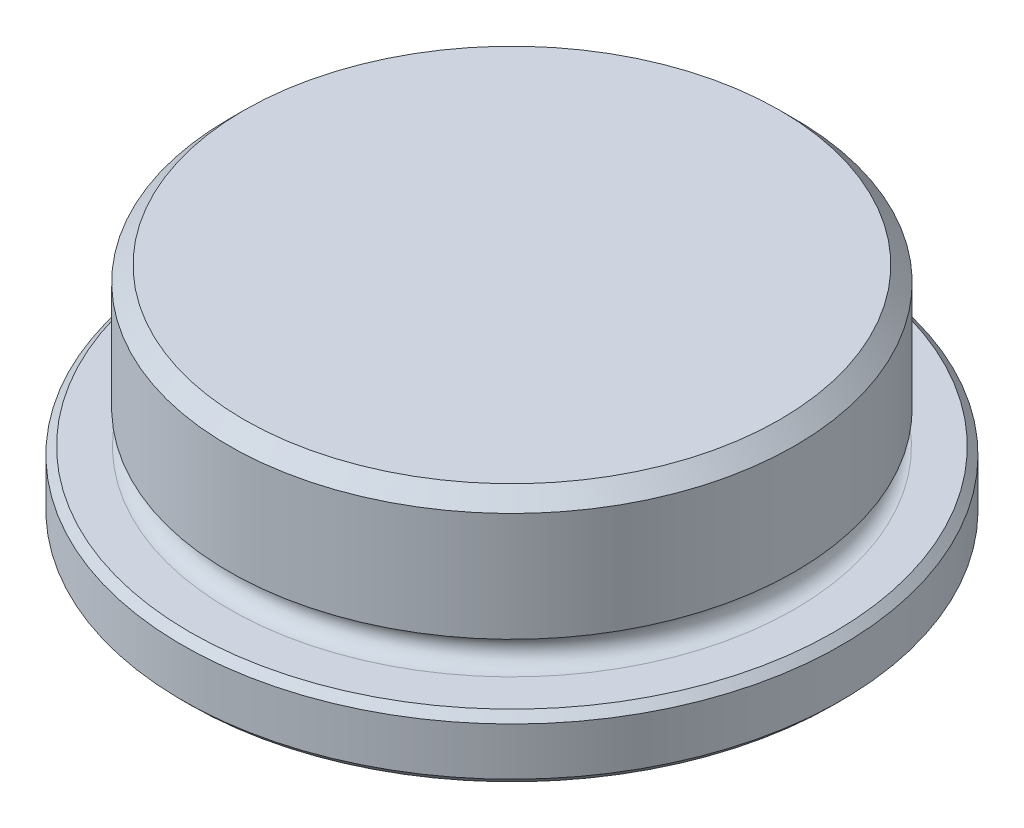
ISO-10303-21;
HEADER;
FILE_DESCRIPTION(('STEP AP214'),'2;1');
FILE_NAME('part.step','',(''),(''),'','','');
FILE_SCHEMA(('AUTOMOTIVE_DESIGN { 1 0 10303 214 1 1 1 1 }'));
ENDSEC;
DATA;
#1=APPLICATION_CONTEXT('core data for automotive mechanical design processes');
#2=APPLICATION_PROTOCOL_DEFINITION('international standard','automotive_design',2000,#1);
#3=PRODUCT_CONTEXT('',#1,'mechanical');
#4=PRODUCT('Part','Part','',(#3));
#5=PRODUCT_RELATED_PRODUCT_CATEGORY('part','',(#4));
#6=PRODUCT_DEFINITION_FORMATION('','',#4);
#7=PRODUCT_DEFINITION_CONTEXT('part definition',#1,'design');
#8=PRODUCT_DEFINITION('design','',#6,#7);
#9=PRODUCT_DEFINITION_SHAPE('','',#8);
#10=(LENGTH_UNIT() NAMED_UNIT(*) SI_UNIT(.MILLI.,.METRE.));
#11=(NAMED_UNIT(*) PLANE_ANGLE_UNIT() SI_UNIT($,.RADIAN.));
#12=(NAMED_UNIT(*) SI_UNIT($,.STERADIAN.) SOLID_ANGLE_UNIT());
#13=UNCERTAINTY_MEASURE_WITH_UNIT(LENGTH_MEASURE(1.E-05),#10,'distance_accuracy_value','');
#14=(GEOMETRIC_REPRESENTATION_CONTEXT(3) GLOBAL_UNCERTAINTY_ASSIGNED_CONTEXT((#13)) GLOBAL_UNIT_ASSIGNED_CONTEXT((#10,
#11,#12)) REPRESENTATION_CONTEXT('',''));
#15=CARTESIAN_POINT('',(0.,0.,0.));
#16=DIRECTION('',(0.,0.,1.));
#17=DIRECTION('',(1.,0.,0.));
#18=AXIS2_PLACEMENT_3D('',#15,#16,#17);
#19=CARTESIAN_POINT('',(13.5255,11.0998,0.));
#20=DIRECTION('',(0.,-1.,0.));
#21=DIRECTION('',(1.,0.,0.));
#22=AXIS2_PLACEMENT_3D('',#19,#20,#21);
#23=PLANE('',#22);
#24=CARTESIAN_POINT('',(0.,11.0998,0.));
#25=DIRECTION('',(0.,1.,0.));
#26=DIRECTION('',(-1.,0.,0.));
#27=AXIS2_PLACEMENT_3D('',#24,#25,#26);
#28=CIRCLE('',#27,13.5255);
#29=CARTESIAN_POINT('',(-13.5255,11.0998,0.));
#30=VERTEX_POINT('',#29);
#31=EDGE_CURVE('E52',#30,#30,#28,.T.);
#32=ORIENTED_EDGE('',*,*,#31,.T.);
#33=EDGE_LOOP('',(#32));
#34=FACE_BOUND('',#33,.T.);
#35=ADVANCED_FACE('F39',(#34),#23,.F.);
#36=CARTESIAN_POINT('',(0.,10.3378,0.));
#37=DIRECTION('',(0.,-1.,0.));
#38=DIRECTION('',(1.,0.,0.));
#39=AXIS2_PLACEMENT_3D('',#36,#37,#38);
#40=CONICAL_SURFACE('',#39,14.2875,0.78539816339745);
#41=ORIENTED_EDGE('',*,*,#31,.F.);
#42=EDGE_LOOP('',(#41));
#43=FACE_BOUND('',#42,.T.);
#44=CARTESIAN_POINT('',(0.,10.3378,0.));
#45=DIRECTION('',(0.,1.,0.));
#46=DIRECTION('',(-1.,0.,0.));
#47=AXIS2_PLACEMENT_3D('',#44,#45,#46);
#48=CIRCLE('',#47,14.2875);
#49=CARTESIAN_POINT('',(-14.2875,10.3378,0.));
#50=VERTEX_POINT('',#49);
#51=EDGE_CURVE('E143',#50,#50,#48,.T.);
#52=ORIENTED_EDGE('',*,*,#51,.T.);
#53=EDGE_LOOP('',(#52));
#54=FACE_BOUND('',#53,.T.);
#55=ADVANCED_FACE('F149',(#43,#54),#40,.T.);
#56=CARTESIAN_POINT('',(0.,11.0998,0.));
#57=DIRECTION('',(0.,1.,0.));
#58=DIRECTION('',(-1.,0.,0.));
#59=AXIS2_PLACEMENT_3D('',#56,#57,#58);
#60=CYLINDRICAL_SURFACE('',#59,14.2875);
#61=ORIENTED_EDGE('',*,*,#51,.F.);
#62=EDGE_LOOP('',(#61));
#63=FACE_BOUND('',#62,.T.);
#64=CARTESIAN_POINT('',(0.,4.83562345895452,0.));
#65=DIRECTION('',(0.,1.,0.));
#66=DIRECTION('',(-1.,0.,0.));
#67=AXIS2_PLACEMENT_3D('',#64,#65,#66);
#68=CIRCLE('',#67,14.2875);
#69=CARTESIAN_POINT('',(-14.2875,4.83562345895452,0.));
#70=VERTEX_POINT('',#69);
#71=EDGE_CURVE('E140',#70,#70,#68,.T.);
#72=ORIENTED_EDGE('',*,*,#71,.T.);
#73=EDGE_LOOP('',(#72));
#74=FACE_BOUND('',#73,.T.);
#75=ADVANCED_FACE('F152',(#63,#74),#60,.T.);
#76=CARTESIAN_POINT('',(0.,4.72675409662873,0.));
#77=DIRECTION('',(0.,1.,0.));
#78=DIRECTION('',(-1.,0.,0.));
#79=AXIS2_PLACEMENT_3D('',#76,#77,#78);
#80=CONICAL_SURFACE('',#79,13.9883838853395,1.22173047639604);
#81=ORIENTED_EDGE('',*,*,#71,.F.);
#82=EDGE_LOOP('',(#81));
#83=FACE_BOUND('',#82,.T.);
#84=CARTESIAN_POINT('',(0.,4.72675409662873,0.));
#85=DIRECTION('',(0.,1.,0.));
#86=DIRECTION('',(-1.,0.,0.));
#87=AXIS2_PLACEMENT_3D('',#84,#85,#86);
#88=CIRCLE('',#87,13.9883838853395);
#89=CARTESIAN_POINT('',(-13.9883838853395,4.72675409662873,0.));
#90=VERTEX_POINT('',#89);
#91=EDGE_CURVE('E137',#90,#90,#88,.T.);
#92=ORIENTED_EDGE('',*,*,#91,.T.);
#93=EDGE_LOOP('',(#92));
#94=FACE_BOUND('',#93,.T.);
#95=ADVANCED_FACE('F157',(#83,#94),#80,.T.);
#96=CARTESIAN_POINT('',(0.,3.975,0.));
#97=DIRECTION('',(0.,1.,0.));
#98=DIRECTION('',(-1.,0.,0.));
#99=AXIS2_PLACEMENT_3D('',#96,#97,#98);
#100=TOROIDAL_SURFACE('',#99,14.262,0.8);
#101=ORIENTED_EDGE('',*,*,#91,.F.);
#102=EDGE_LOOP('',(#101));
#103=FACE_BOUND('',#102,.T.);
#104=CARTESIAN_POINT('',(0.,3.175,0.));
#105=DIRECTION('',(0.,1.,0.));
#106=DIRECTION('',(-1.,0.,0.));
#107=AXIS2_PLACEMENT_3D('',#104,#105,#106);
#108=CIRCLE('',#107,14.262);
#109=CARTESIAN_POINT('',(-14.262,3.175,0.));
#110=VERTEX_POINT('',#109);
#111=EDGE_CURVE('E134',#110,#110,#108,.T.);
#112=ORIENTED_EDGE('',*,*,#111,.T.);
#113=EDGE_LOOP('',(#112));
#114=FACE_BOUND('',#113,.T.);
#115=ADVANCED_FACE('F163',(#103,#114),#100,.F.);
#116=CARTESIAN_POINT('',(16.256,3.175,0.));
#117=DIRECTION('',(0.,-1.,0.));
#118=DIRECTION('',(1.,0.,0.));
#119=AXIS2_PLACEMENT_3D('',#116,#117,#118);
#120=PLANE('',#119);
#121=ORIENTED_EDGE('',*,*,#111,.F.);
#122=EDGE_LOOP('',(#121));
#123=FACE_BOUND('',#122,.T.);
#124=CARTESIAN_POINT('',(0.,3.175,0.));
#125=DIRECTION('',(0.,1.,0.));
#126=DIRECTION('',(-1.,0.,0.));
#127=AXIS2_PLACEMENT_3D('',#124,#125,#126);
#128=CIRCLE('',#127,16.256);
#129=CARTESIAN_POINT('',(-16.256,3.175,0.));
#130=VERTEX_POINT('',#129);
#131=EDGE_CURVE('E131',#130,#130,#128,.T.);
#132=ORIENTED_EDGE('',*,*,#131,.T.);
#133=EDGE_LOOP('',(#132));
#134=FACE_BOUND('',#133,.T.);
#135=ADVANCED_FACE('F169',(#123,#134),#120,.F.);
#136=CARTESIAN_POINT('',(0.,2.794,0.));
#137=DIRECTION('',(0.,-1.,0.));
#138=DIRECTION('',(1.,0.,0.));
#139=AXIS2_PLACEMENT_3D('',#136,#137,#138);
#140=CONICAL_SURFACE('',#139,16.637,0.785398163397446);
#141=ORIENTED_EDGE('',*,*,#131,.F.);
#142=EDGE_LOOP('',(#141));
#143=FACE_BOUND('',#142,.T.);
#144=CARTESIAN_POINT('',(0.,2.794,0.));
#145=DIRECTION('',(0.,1.,0.));
#146=DIRECTION('',(-1.,0.,0.));
#147=AXIS2_PLACEMENT_3D('',#144,#145,#146);
#148=CIRCLE('',#147,16.637);
#149=CARTESIAN_POINT('',(-16.637,2.794,0.));
#150=VERTEX_POINT('',#149);
#151=EDGE_CURVE('E128',#150,#150,#148,.T.);
#152=ORIENTED_EDGE('',*,*,#151,.T.);
#153=EDGE_LOOP('',(#152));
#154=FACE_BOUND('',#153,.T.);
#155=ADVANCED_FACE('F175',(#143,#154),#140,.T.);
#156=CARTESIAN_POINT('',(0.,11.0998,0.));
#157=DIRECTION('',(0.,1.,0.));
#158=DIRECTION('',(-1.,0.,0.));
#159=AXIS2_PLACEMENT_3D('',#156,#157,#158);
#160=CYLINDRICAL_SURFACE('',#159,16.637);
#161=ORIENTED_EDGE('',*,*,#151,.F.);
#162=EDGE_LOOP('',(#161));
#163=FACE_BOUND('',#162,.T.);
#164=CARTESIAN_POINT('',(0.,0.381000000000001,0.));
#165=DIRECTION('',(0.,1.,0.));
#166=DIRECTION('',(-1.,0.,0.));
#167=AXIS2_PLACEMENT_3D('',#164,#165,#166);
#168=CIRCLE('',#167,16.637);
#169=CARTESIAN_POINT('',(-16.637,0.381000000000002,0.));
#170=VERTEX_POINT('',#169);
#171=EDGE_CURVE('E125',#170,#170,#168,.T.);
#172=ORIENTED_EDGE('',*,*,#171,.T.);
#173=EDGE_LOOP('',(#172));
#174=FACE_BOUND('',#173,.T.);
#175=ADVANCED_FACE('F181',(#163,#174),#160,.T.);
#176=CARTESIAN_POINT('',(0.,0.,0.));
#177=DIRECTION('',(0.,1.,0.));
#178=DIRECTION('',(-1.,0.,0.));
#179=AXIS2_PLACEMENT_3D('',#176,#177,#178);
#180=CONICAL_SURFACE('',#179,16.256,0.785398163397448);
#181=ORIENTED_EDGE('',*,*,#171,.F.);
#182=EDGE_LOOP('',(#181));
#183=FACE_BOUND('',#182,.T.);
#184=CARTESIAN_POINT('',(0.,0.,0.));
#185=DIRECTION('',(0.,1.,0.));
#186=DIRECTION('',(-1.,0.,0.));
#187=AXIS2_PLACEMENT_3D('',#184,#185,#186);
#188=CIRCLE('',#187,16.256);
#189=CARTESIAN_POINT('',(-16.256,0.,0.));
#190=VERTEX_POINT('',#189);
#191=EDGE_CURVE('E122',#190,#190,#188,.T.);
#192=ORIENTED_EDGE('',*,*,#191,.T.);
#193=EDGE_LOOP('',(#192));
#194=FACE_BOUND('',#193,.T.);
#195=ADVANCED_FACE('F187',(#183,#194),#180,.T.);
#196=CARTESIAN_POINT('',(0.,0.,0.));
#197=DIRECTION('',(0.,1.,0.));
#198=DIRECTION('',(-1.,0.,0.));
#199=AXIS2_PLACEMENT_3D('',#196,#197,#198);
#200=PLANE('',#199);
#201=CARTESIAN_POINT('',(0.,0.,0.));
#202=DIRECTION('',(0.,1.,0.));
#203=DIRECTION('',(0.,0.,1.));
#204=AXIS2_PLACEMENT_3D('',#201,#202,#203);
#205=CIRCLE('',#204,5.75326131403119);
#206=CARTESIAN_POINT('',(0.,0.,5.75326131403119));
#207=VERTEX_POINT('',#206);
#208=EDGE_CURVE('E421',#207,#207,#205,.T.);
#209=ORIENTED_EDGE('',*,*,#208,.T.);
#210=EDGE_LOOP('',(#209));
#211=FACE_BOUND('',#210,.T.);
#212=ORIENTED_EDGE('',*,*,#191,.F.);
#213=EDGE_LOOP('',(#212));
#214=FACE_BOUND('',#213,.T.);
#215=ADVANCED_FACE('F193',(#211,#214),#200,.F.);
#216=CARTESIAN_POINT('',(0.,3.70346252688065,0.));
#217=DIRECTION('',(0.,-1.,0.));
#218=DIRECTION('',(0.,0.,-1.));
#219=AXIS2_PLACEMENT_3D('',#216,#217,#218);
#220=CONICAL_SURFACE('',#219,2.0497987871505,0.785398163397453);
#221=ORIENTED_EDGE('',*,*,#208,.F.);
#222=EDGE_LOOP('',(#221));
#223=FACE_BOUND('',#222,.T.);
#224=CARTESIAN_POINT('',(5.49937678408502,0.253884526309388,-0.000199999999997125));
#225=CARTESIAN_POINT('',(5.45209794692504,0.30115924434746,0.0816893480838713));
#226=CARTESIAN_POINT('',(5.40445569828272,0.346983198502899,0.164208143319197));
#227=CARTESIAN_POINT('',(5.30837307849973,0.43528825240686,0.330628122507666));
#228=CARTESIAN_POINT('',(5.25993228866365,0.47776752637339,0.414530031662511));
#229=CARTESIAN_POINT('',(5.11285510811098,0.599888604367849,0.669275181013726));
#230=CARTESIAN_POINT('',(5.01297361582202,0.673692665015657,0.842275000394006));
#231=CARTESIAN_POINT('',(4.81155458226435,0.800077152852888,1.19114300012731));
#232=CARTESIAN_POINT('',(4.71006852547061,0.852975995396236,1.36692200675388));
#233=CARTESIAN_POINT('',(4.55617092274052,0.914167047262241,1.63348047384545));
#234=CARTESIAN_POINT('',(4.5046451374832,0.931529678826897,1.72272575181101));
#235=CARTESIAN_POINT('',(4.40115727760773,0.95980962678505,1.90197198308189));
#236=CARTESIAN_POINT('',(4.34919526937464,0.970727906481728,1.99197282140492));
#237=CARTESIAN_POINT('',(4.22257233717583,0.989033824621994,2.2112901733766));
#238=CARTESIAN_POINT('',(4.14777498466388,0.992874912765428,2.34084298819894));
#239=CARTESIAN_POINT('',(3.99831507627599,0.986428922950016,2.59971514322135));
#240=CARTESIAN_POINT('',(3.92365257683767,0.976136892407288,2.72903438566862));
#241=CARTESIAN_POINT('',(3.77503146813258,0.942031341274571,2.98645369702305));
#242=CARTESIAN_POINT('',(3.7010737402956,0.918202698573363,3.11455223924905));
#243=CARTESIAN_POINT('',(3.554429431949,0.858319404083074,3.36854763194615));
#244=CARTESIAN_POINT('',(3.4817427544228,0.822265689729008,3.49444465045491));
#245=CARTESIAN_POINT('',(3.35270833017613,0.748090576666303,3.71793882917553));
#246=CARTESIAN_POINT('',(3.29607491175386,0.711919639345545,3.81603078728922));
#247=CARTESIAN_POINT('',(3.18382475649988,0.633748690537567,4.0104537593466));
#248=CARTESIAN_POINT('',(3.12820805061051,0.591748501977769,4.1067847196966));
#249=CARTESIAN_POINT('',(3.01816648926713,0.502860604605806,4.29738229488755));
#250=CARTESIAN_POINT('',(2.96373850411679,0.455988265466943,4.39165433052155));
#251=CARTESIAN_POINT('',(2.85589043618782,0.357971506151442,4.57845266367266));
#252=CARTESIAN_POINT('',(2.80246975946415,0.306829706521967,4.67097998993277));
#253=CARTESIAN_POINT('',(2.74951518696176,0.253884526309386,4.7627));
#254=B_SPLINE_CURVE_WITH_KNOTS('',3,(#224,#225,#226,#227,#228,#229,#230,#231,#232,#233,#234,
#235,#236,#237,#238,#239,#240,#241,#242,#243,#244,#245,#246,#247,#248,#249,#250,#251,#252,#253),
.UNSPECIFIED.,.F.,.F.,(4,2,2,2,2,2,2,2,2,2,2,2,2,2,4),(0.,0.317131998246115,0.634435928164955,
1.2724696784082,1.90037160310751,2.21370673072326,2.52699500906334,2.97522950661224,
3.42362111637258,3.87251462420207,4.32137371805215,4.67791268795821,5.03446249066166,
5.38991982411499,5.74516056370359),.UNSPECIFIED.);
#255=CARTESIAN_POINT('',(5.49926131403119,0.254000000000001,0.));
#256=VERTEX_POINT('',#255);
#257=CARTESIAN_POINT('',(2.7496306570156,0.253999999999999,4.7625));
#258=VERTEX_POINT('',#257);
#259=EDGE_CURVE('E106',#256,#258,#254,.T.);
#260=ORIENTED_EDGE('',*,*,#259,.F.);
#261=CARTESIAN_POINT('',(2.74951518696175,0.253884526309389,-4.7627));
#262=CARTESIAN_POINT('',(2.79679402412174,0.301159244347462,-4.68081065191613));
#263=CARTESIAN_POINT('',(2.84443627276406,0.346983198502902,-4.5982918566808));
#264=CARTESIAN_POINT('',(2.94051889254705,0.435288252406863,-4.43187187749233));
#265=CARTESIAN_POINT('',(2.98895968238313,0.477767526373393,-4.34796996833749));
#266=CARTESIAN_POINT('',(3.1360368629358,0.599888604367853,-4.09322481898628));
#267=CARTESIAN_POINT('',(3.23591835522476,0.673692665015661,-3.92022499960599));
#268=CARTESIAN_POINT('',(3.43733738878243,0.800077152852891,-3.57135699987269));
#269=CARTESIAN_POINT('',(3.53882344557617,0.85297599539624,-3.39557799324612));
#270=CARTESIAN_POINT('',(3.69272104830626,0.914167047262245,-3.12901952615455));
#271=CARTESIAN_POINT('',(3.74424683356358,0.931529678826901,-3.03977424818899));
#272=CARTESIAN_POINT('',(3.84773469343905,0.959809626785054,-2.86052801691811));
#273=CARTESIAN_POINT('',(3.89969670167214,0.970727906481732,-2.77052717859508));
#274=CARTESIAN_POINT('',(4.02631963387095,0.989033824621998,-2.5512098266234));
#275=CARTESIAN_POINT('',(4.1011169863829,0.992874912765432,-2.42165701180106));
#276=CARTESIAN_POINT('',(4.25057689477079,0.986428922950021,-2.16278485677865));
#277=CARTESIAN_POINT('',(4.32523939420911,0.976136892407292,-2.03346561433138));
#278=CARTESIAN_POINT('',(4.4738605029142,0.942031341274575,-1.77604630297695));
#279=CARTESIAN_POINT('',(4.54781823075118,0.918202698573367,-1.64794776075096));
#280=CARTESIAN_POINT('',(4.69446253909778,0.858319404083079,-1.39395236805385));
#281=CARTESIAN_POINT('',(4.76714921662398,0.822265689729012,-1.26805534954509));
#282=CARTESIAN_POINT('',(4.89618364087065,0.748090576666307,-1.04456117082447));
#283=CARTESIAN_POINT('',(4.95281705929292,0.71191963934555,-0.946469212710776));
#284=CARTESIAN_POINT('',(5.0650672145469,0.633748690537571,-0.7520462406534));
#285=CARTESIAN_POINT('',(5.12068392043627,0.591748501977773,-0.655715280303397));
#286=CARTESIAN_POINT('',(5.23072548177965,0.502860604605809,-0.465117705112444));
#287=CARTESIAN_POINT('',(5.28515346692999,0.455988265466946,-0.370845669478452));
#288=CARTESIAN_POINT('',(5.39300153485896,0.357971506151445,-0.184047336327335));
#289=CARTESIAN_POINT('',(5.44642221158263,0.30682970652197,-0.0915200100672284));
#290=CARTESIAN_POINT('',(5.49937678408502,0.253884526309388,0.000200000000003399));
#291=B_SPLINE_CURVE_WITH_KNOTS('',3,(#261,#262,#263,#264,#265,#266,#267,#268,#269,#270,#271,
#272,#273,#274,#275,#276,#277,#278,#279,#280,#281,#282,#283,#284,#285,#286,#287,#288,#289,#290),
.UNSPECIFIED.,.F.,.F.,(4,2,2,2,2,2,2,2,2,2,2,2,2,2,4),(0.,0.317131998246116,0.634435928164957,
1.2724696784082,1.90037160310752,2.21370673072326,2.52699500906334,2.97522950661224,
3.42362111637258,3.87251462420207,4.32137371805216,4.67791268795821,5.03446249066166,
5.38991982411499,5.74516056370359),.UNSPECIFIED.);
#292=CARTESIAN_POINT('',(2.74963065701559,0.254000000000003,-4.7625));
#293=VERTEX_POINT('',#292);
#294=EDGE_CURVE('E407',#293,#256,#291,.T.);
#295=ORIENTED_EDGE('',*,*,#294,.F.);
#296=CARTESIAN_POINT('',(-9.37987663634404,-4.76641035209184,-4.7625));
#297=CARTESIAN_POINT('',(-9.2430834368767,-4.64444125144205,-4.7625));
#298=CARTESIAN_POINT('',(-9.10602152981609,-4.52277352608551,-4.7625));
#299=CARTESIAN_POINT('',(-8.83128679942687,-4.28012666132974,-4.7625));
#300=CARTESIAN_POINT('',(-8.69361396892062,-4.15914753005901,-4.7625));
#301=CARTESIAN_POINT('',(-8.27947694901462,-3.79729156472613,-4.7625));
#302=CARTESIAN_POINT('',(-8.00199000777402,-3.55758176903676,-4.7625));
#303=CARTESIAN_POINT('',(-7.44005764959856,-3.07928163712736,-4.7625));
#304=CARTESIAN_POINT('',(-7.155568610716,-2.84074240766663,-4.7625));
#305=CARTESIAN_POINT('',(-6.58198155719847,-2.36937067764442,-4.7625));
#306=CARTESIAN_POINT('',(-6.29288447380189,-2.13653704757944,-4.7625));
#307=CARTESIAN_POINT('',(-5.72492406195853,-1.69164785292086,-4.7625));
#308=CARTESIAN_POINT('',(-5.44640161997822,-1.47916066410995,-4.7625));
#309=CARTESIAN_POINT('',(-5.02297773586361,-1.16791096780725,-4.7625));
#310=CARTESIAN_POINT('',(-4.88084995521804,-1.06537626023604,-4.7625));
#311=CARTESIAN_POINT('',(-4.59443356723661,-0.863376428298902,-4.7625));
#312=CARTESIAN_POINT('',(-4.45014507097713,-0.763911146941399,-4.7625));
#313=CARTESIAN_POINT('',(-4.15946725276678,-0.568999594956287,-4.7625));
#314=CARTESIAN_POINT('',(-4.01308510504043,-0.473542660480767,-4.7625));
#315=CARTESIAN_POINT('',(-3.71740287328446,-0.287211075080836,-4.7625));
#316=CARTESIAN_POINT('',(-3.56810254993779,-0.196336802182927,-4.7625));
#317=CARTESIAN_POINT('',(-3.26630319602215,-0.020396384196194,-4.7625));
#318=CARTESIAN_POINT('',(-3.11380757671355,0.064675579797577,-4.7625));
#319=CARTESIAN_POINT('',(-2.80504320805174,0.227640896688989,-4.7625));
#320=CARTESIAN_POINT('',(-2.6487753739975,0.305535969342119,-4.7625));
#321=CARTESIAN_POINT('',(-2.34333397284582,0.447072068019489,-4.7625));
#322=CARTESIAN_POINT('',(-2.19445020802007,0.511333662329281,-4.7625));
#323=CARTESIAN_POINT('',(-1.8928559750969,0.630262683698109,-4.7625));
#324=CARTESIAN_POINT('',(-1.74014550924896,0.684930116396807,-4.7625));
#325=CARTESIAN_POINT('',(-1.43171334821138,0.782353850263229,-4.7625));
#326=CARTESIAN_POINT('',(-1.27600927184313,0.825165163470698,-4.7625));
#327=CARTESIAN_POINT('',(-0.96148100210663,0.897084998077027,-4.7625));
#328=CARTESIAN_POINT('',(-0.802658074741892,0.926198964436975,-4.7625));
#329=CARTESIAN_POINT('',(-0.480440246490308,0.969290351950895,-4.7625));
#330=CARTESIAN_POINT('',(-0.317012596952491,0.983028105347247,-4.7625));
#331=CARTESIAN_POINT('',(0.0103831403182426,0.993560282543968,-4.7625));
#332=CARTESIAN_POINT('',(0.174351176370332,0.990356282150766,-4.7625));
#333=CARTESIAN_POINT('',(0.50147771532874,0.967220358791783,-4.7625));
#334=CARTESIAN_POINT('',(0.664633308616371,0.947248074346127,-4.7625));
#335=CARTESIAN_POINT('',(0.988301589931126,0.891916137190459,-4.7625));
#336=CARTESIAN_POINT('',(1.14881351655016,0.856552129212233,-4.7625));
#337=CARTESIAN_POINT('',(1.5158811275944,0.759372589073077,-4.7625));
#338=CARTESIAN_POINT('',(1.72115283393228,0.692744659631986,-4.7625));
#339=CARTESIAN_POINT('',(2.12494286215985,0.541578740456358,-4.7625));
#340=CARTESIAN_POINT('',(2.32345726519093,0.457030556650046,-4.7625));
#341=CARTESIAN_POINT('',(2.71614026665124,0.273446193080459,-4.7625));
#342=CARTESIAN_POINT('',(2.91024121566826,0.174267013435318,-4.7625));
#343=CARTESIAN_POINT('',(3.19705270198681,0.0177434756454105,-4.7625));
#344=CARTESIAN_POINT('',(3.2919229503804,-0.0357171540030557,-4.7625));
#345=CARTESIAN_POINT('',(3.48035243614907,-0.144904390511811,-4.7625));
#346=CARTESIAN_POINT('',(3.57391167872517,-0.200630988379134,-4.7625));
#347=CARTESIAN_POINT('',(3.80071811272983,-0.338996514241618,-4.7625));
#348=CARTESIAN_POINT('',(3.93332059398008,-0.422691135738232,-4.7625));
#349=CARTESIAN_POINT('',(4.1963435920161,-0.593448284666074,-4.7625));
#350=CARTESIAN_POINT('',(4.32676393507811,-0.680511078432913,-4.7625));
#351=CARTESIAN_POINT('',(4.71524490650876,-0.945919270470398,-4.7625));
#352=CARTESIAN_POINT('',(4.97045352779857,-1.12843972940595,-4.7625));
#353=CARTESIAN_POINT('',(5.47549688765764,-1.50163926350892,-4.7625));
#354=CARTESIAN_POINT('',(5.72532092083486,-1.69233267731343,-4.7625));
#355=CARTESIAN_POINT('',(6.22047545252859,-2.07948478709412,-4.7625));
#356=CARTESIAN_POINT('',(6.46580563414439,-2.27594388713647,-4.7625));
#357=CARTESIAN_POINT('',(6.93717767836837,-2.66032821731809,-4.7625));
#358=CARTESIAN_POINT('',(7.16344063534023,-2.84798334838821,-4.7625));
#359=CARTESIAN_POINT('',(7.61348980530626,-3.22625903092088,-4.7625));
#360=CARTESIAN_POINT('',(7.83727589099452,-3.41687973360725,-4.7625));
#361=CARTESIAN_POINT('',(8.28181433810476,-3.79959672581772,-4.7625));
#362=CARTESIAN_POINT('',(8.50257585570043,-3.99168240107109,-4.7625));
#363=CARTESIAN_POINT('',(8.94240582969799,-4.37773547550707,-4.7625));
#364=CARTESIAN_POINT('',(9.16147446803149,-4.57170266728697,-4.7625));
#365=CARTESIAN_POINT('',(9.37987663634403,-4.76641035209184,-4.7625));
#366=B_SPLINE_CURVE_WITH_KNOTS('',3,(#296,#297,#298,#299,#300,#301,#302,#303,#304,#305,#306,
#307,#308,#309,#310,#311,#312,#313,#314,#315,#316,#317,#318,#319,#320,#321,#322,#323,#324,#325,
#326,#327,#328,#329,#330,#331,#332,#333,#334,#335,#336,#337,#338,#339,#340,#341,#342,#343,#344,
#345,#346,#347,#348,#349,#350,#351,#352,#353,#354,#355,#356,#357,#358,#359,#360,#361,#362,#363,
#364,#365),.UNSPECIFIED.,.F.,.F.,(4,2,2,2,2,2,2,2,2,2,2,2,2,2,2,2,2,2,2,2,2,2,2,2,2,2,2,2,2,2,2,
2,2,2,4),(0.,0.549816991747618,1.09964046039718,2.19967276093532,3.31340261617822,
4.42691018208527,5.47769242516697,6.003420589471,6.52912181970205,7.05332212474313,
7.57756560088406,8.10127535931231,8.62485929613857,9.11107015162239,9.59728072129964,
10.0811959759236,10.5649187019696,11.0560805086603,11.5471966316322,12.0394982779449,
12.5319393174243,13.1782469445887,13.8249232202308,14.4783996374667,14.8050655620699,
15.131730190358,15.6020838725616,16.0724748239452,17.0135106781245,17.9562710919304,
18.8990977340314,19.7809321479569,20.6628116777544,21.5406912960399,22.4184752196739),.UNSPECIFIED.);
#367=CARTESIAN_POINT('',(-2.7496306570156,0.254,-4.7625));
#368=VERTEX_POINT('',#367);
#369=EDGE_CURVE('E402',#368,#293,#366,.T.);
#370=ORIENTED_EDGE('',*,*,#369,.F.);
#371=CARTESIAN_POINT('',(-5.49937678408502,0.253884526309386,0.000200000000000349));
#372=CARTESIAN_POINT('',(-5.45209794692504,0.301159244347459,-0.0816893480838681));
#373=CARTESIAN_POINT('',(-5.40445569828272,0.346983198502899,-0.164208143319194));
#374=CARTESIAN_POINT('',(-5.30837307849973,0.43528825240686,-0.330628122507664));
#375=CARTESIAN_POINT('',(-5.25993228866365,0.47776752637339,-0.414530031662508));
#376=CARTESIAN_POINT('',(-5.11285510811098,0.59988860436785,-0.669275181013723));
#377=CARTESIAN_POINT('',(-5.01297361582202,0.673692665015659,-0.842275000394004));
#378=CARTESIAN_POINT('',(-4.81155458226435,0.800077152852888,-1.19114300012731));
#379=CARTESIAN_POINT('',(-4.71006852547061,0.852975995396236,-1.36692200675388));
#380=CARTESIAN_POINT('',(-4.55617092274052,0.914167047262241,-1.63348047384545));
#381=CARTESIAN_POINT('',(-4.5046451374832,0.931529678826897,-1.72272575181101));
#382=CARTESIAN_POINT('',(-4.40115727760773,0.95980962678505,-1.90197198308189));
#383=CARTESIAN_POINT('',(-4.34919526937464,0.970727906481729,-1.99197282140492));
#384=CARTESIAN_POINT('',(-4.22257233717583,0.989033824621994,-2.2112901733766));
#385=CARTESIAN_POINT('',(-4.14777498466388,0.992874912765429,-2.34084298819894));
#386=CARTESIAN_POINT('',(-3.99831507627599,0.986428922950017,-2.59971514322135));
#387=CARTESIAN_POINT('',(-3.92365257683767,0.976136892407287,-2.72903438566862));
#388=CARTESIAN_POINT('',(-3.77503146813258,0.94203134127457,-2.98645369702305));
#389=CARTESIAN_POINT('',(-3.7010737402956,0.918202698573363,-3.11455223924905));
#390=CARTESIAN_POINT('',(-3.554429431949,0.858319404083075,-3.36854763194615));
#391=CARTESIAN_POINT('',(-3.4817427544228,0.822265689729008,-3.49444465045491));
#392=CARTESIAN_POINT('',(-3.35270833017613,0.748090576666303,-3.71793882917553));
#393=CARTESIAN_POINT('',(-3.29607491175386,0.711919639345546,-3.81603078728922));
#394=CARTESIAN_POINT('',(-3.18382475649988,0.633748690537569,-4.0104537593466));
#395=CARTESIAN_POINT('',(-3.12820805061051,0.59174850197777,-4.1067847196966));
#396=CARTESIAN_POINT('',(-3.01816648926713,0.502860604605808,-4.29738229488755));
#397=CARTESIAN_POINT('',(-2.96373850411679,0.455988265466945,-4.39165433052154));
#398=CARTESIAN_POINT('',(-2.85589043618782,0.357971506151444,-4.57845266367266));
#399=CARTESIAN_POINT('',(-2.80246975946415,0.306829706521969,-4.67097998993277));
#400=CARTESIAN_POINT('',(-2.74951518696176,0.253884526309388,-4.7627));
#401=B_SPLINE_CURVE_WITH_KNOTS('',3,(#371,#372,#373,#374,#375,#376,#377,#378,#379,#380,#381,
#382,#383,#384,#385,#386,#387,#388,#389,#390,#391,#392,#393,#394,#395,#396,#397,#398,#399,#400),
.UNSPECIFIED.,.F.,.F.,(4,2,2,2,2,2,2,2,2,2,2,2,2,2,4),(0.,0.317131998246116,0.634435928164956,
1.2724696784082,1.90037160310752,2.21370673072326,2.52699500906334,2.97522950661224,
3.42362111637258,3.87251462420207,4.32137371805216,4.67791268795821,5.03446249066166,
5.38991982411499,5.74516056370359),.UNSPECIFIED.);
#402=CARTESIAN_POINT('',(-5.49926131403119,0.254000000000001,0.));
#403=VERTEX_POINT('',#402);
#404=EDGE_CURVE('E59',#403,#368,#401,.T.);
#405=ORIENTED_EDGE('',*,*,#404,.F.);
#406=CARTESIAN_POINT('',(-2.74951518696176,0.253884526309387,4.7627));
#407=CARTESIAN_POINT('',(-2.79679402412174,0.301159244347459,4.68081065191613));
#408=CARTESIAN_POINT('',(-2.84443627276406,0.346983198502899,4.59829185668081));
#409=CARTESIAN_POINT('',(-2.94051889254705,0.43528825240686,4.43187187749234));
#410=CARTESIAN_POINT('',(-2.98895968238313,0.47776752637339,4.34796996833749));
#411=CARTESIAN_POINT('',(-3.1360368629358,0.59988860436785,4.09322481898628));
#412=CARTESIAN_POINT('',(-3.23591835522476,0.673692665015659,3.920224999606));
#413=CARTESIAN_POINT('',(-3.43733738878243,0.800077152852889,3.57135699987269));
#414=CARTESIAN_POINT('',(-3.53882344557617,0.852975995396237,3.39557799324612));
#415=CARTESIAN_POINT('',(-3.69272104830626,0.914167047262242,3.12901952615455));
#416=CARTESIAN_POINT('',(-3.74424683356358,0.931529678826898,3.03977424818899));
#417=CARTESIAN_POINT('',(-3.84773469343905,0.959809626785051,2.86052801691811));
#418=CARTESIAN_POINT('',(-3.89969670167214,0.970727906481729,2.77052717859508));
#419=CARTESIAN_POINT('',(-4.02631963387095,0.989033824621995,2.5512098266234));
#420=CARTESIAN_POINT('',(-4.1011169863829,0.99287491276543,2.42165701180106));
#421=CARTESIAN_POINT('',(-4.25057689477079,0.986428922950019,2.16278485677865));
#422=CARTESIAN_POINT('',(-4.32523939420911,0.97613689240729,2.03346561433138));
#423=CARTESIAN_POINT('',(-4.4738605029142,0.942031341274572,1.77604630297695));
#424=CARTESIAN_POINT('',(-4.54781823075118,0.918202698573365,1.64794776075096));
#425=CARTESIAN_POINT('',(-4.69446253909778,0.858319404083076,1.39395236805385));
#426=CARTESIAN_POINT('',(-4.76714921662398,0.82226568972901,1.26805534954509));
#427=CARTESIAN_POINT('',(-4.89618364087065,0.748090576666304,1.04456117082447));
#428=CARTESIAN_POINT('',(-4.95281705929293,0.711919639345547,0.946469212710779));
#429=CARTESIAN_POINT('',(-5.0650672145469,0.633748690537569,0.752046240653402));
#430=CARTESIAN_POINT('',(-5.12068392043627,0.591748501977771,0.655715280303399));
#431=CARTESIAN_POINT('',(-5.23072548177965,0.502860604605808,0.465117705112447));
#432=CARTESIAN_POINT('',(-5.28515346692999,0.455988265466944,0.370845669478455));
#433=CARTESIAN_POINT('',(-5.39300153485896,0.357971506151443,0.184047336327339));
#434=CARTESIAN_POINT('',(-5.44642221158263,0.306829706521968,0.0915200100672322));
#435=CARTESIAN_POINT('',(-5.49937678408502,0.253884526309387,-0.000199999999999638));
#436=B_SPLINE_CURVE_WITH_KNOTS('',3,(#406,#407,#408,#409,#410,#411,#412,#413,#414,#415,#416,
#417,#418,#419,#420,#421,#422,#423,#424,#425,#426,#427,#428,#429,#430,#431,#432,#433,#434,#435),
.UNSPECIFIED.,.F.,.F.,(4,2,2,2,2,2,2,2,2,2,2,2,2,2,4),(0.,0.317131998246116,0.634435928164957,
1.2724696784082,1.90037160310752,2.21370673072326,2.52699500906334,2.97522950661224,
3.42362111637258,3.87251462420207,4.32137371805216,4.67791268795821,5.03446249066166,
5.38991982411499,5.74516056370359),.UNSPECIFIED.);
#437=CARTESIAN_POINT('',(-2.74963065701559,0.254,4.7625));
#438=VERTEX_POINT('',#437);
#439=EDGE_CURVE('E11',#438,#403,#436,.T.);
#440=ORIENTED_EDGE('',*,*,#439,.F.);
#441=CARTESIAN_POINT('',(9.37987663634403,-4.76641035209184,4.7625));
#442=CARTESIAN_POINT('',(9.2430834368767,-4.64444125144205,4.7625));
#443=CARTESIAN_POINT('',(9.10602152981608,-4.52277352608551,4.7625));
#444=CARTESIAN_POINT('',(8.83128679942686,-4.28012666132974,4.7625));
#445=CARTESIAN_POINT('',(8.69361396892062,-4.15914753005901,4.7625));
#446=CARTESIAN_POINT('',(8.27947694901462,-3.79729156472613,4.7625));
#447=CARTESIAN_POINT('',(8.00199000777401,-3.55758176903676,4.7625));
#448=CARTESIAN_POINT('',(7.44005764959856,-3.07928163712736,4.7625));
#449=CARTESIAN_POINT('',(7.155568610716,-2.84074240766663,4.7625));
#450=CARTESIAN_POINT('',(6.58198155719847,-2.36937067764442,4.7625));
#451=CARTESIAN_POINT('',(6.29288447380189,-2.13653704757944,4.7625));
#452=CARTESIAN_POINT('',(5.72492406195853,-1.69164785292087,4.7625));
#453=CARTESIAN_POINT('',(5.44640161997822,-1.47916066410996,4.7625));
#454=CARTESIAN_POINT('',(5.02297773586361,-1.16791096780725,4.7625));
#455=CARTESIAN_POINT('',(4.88084995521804,-1.06537626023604,4.7625));
#456=CARTESIAN_POINT('',(4.59443356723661,-0.863376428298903,4.7625));
#457=CARTESIAN_POINT('',(4.45014507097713,-0.763911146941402,4.7625));
#458=CARTESIAN_POINT('',(4.15946725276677,-0.568999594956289,4.7625));
#459=CARTESIAN_POINT('',(4.01308510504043,-0.473542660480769,4.7625));
#460=CARTESIAN_POINT('',(3.71740287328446,-0.287211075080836,4.7625));
#461=CARTESIAN_POINT('',(3.56810254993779,-0.196336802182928,4.7625));
#462=CARTESIAN_POINT('',(3.26630319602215,-0.0203963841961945,4.7625));
#463=CARTESIAN_POINT('',(3.11380757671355,0.0646755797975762,4.7625));
#464=CARTESIAN_POINT('',(2.80504320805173,0.227640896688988,4.7625));
#465=CARTESIAN_POINT('',(2.6487753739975,0.305535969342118,4.7625));
#466=CARTESIAN_POINT('',(2.34333397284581,0.447072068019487,4.7625));
#467=CARTESIAN_POINT('',(2.19445020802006,0.511333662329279,4.7625));
#468=CARTESIAN_POINT('',(1.8928559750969,0.630262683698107,4.7625));
#469=CARTESIAN_POINT('',(1.74014550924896,0.684930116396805,4.7625));
#470=CARTESIAN_POINT('',(1.43171334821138,0.782353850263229,4.7625));
#471=CARTESIAN_POINT('',(1.27600927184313,0.825165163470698,4.7625));
#472=CARTESIAN_POINT('',(0.961481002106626,0.897084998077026,4.7625));
#473=CARTESIAN_POINT('',(0.802658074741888,0.926198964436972,4.7625));
#474=CARTESIAN_POINT('',(0.480440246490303,0.969290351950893,4.7625));
#475=CARTESIAN_POINT('',(0.317012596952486,0.983028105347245,4.7625));
#476=CARTESIAN_POINT('',(-0.0103831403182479,0.993560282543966,4.7625));
#477=CARTESIAN_POINT('',(-0.174351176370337,0.990356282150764,4.7625));
#478=CARTESIAN_POINT('',(-0.501477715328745,0.967220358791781,4.7625));
#479=CARTESIAN_POINT('',(-0.664633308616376,0.947248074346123,4.7625));
#480=CARTESIAN_POINT('',(-0.988301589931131,0.891916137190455,4.7625));
#481=CARTESIAN_POINT('',(-1.14881351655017,0.85655212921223,4.7625));
#482=CARTESIAN_POINT('',(-1.5158811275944,0.759372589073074,4.7625));
#483=CARTESIAN_POINT('',(-1.72115283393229,0.692744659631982,4.7625));
#484=CARTESIAN_POINT('',(-2.12494286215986,0.541578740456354,4.7625));
#485=CARTESIAN_POINT('',(-2.32345726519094,0.457030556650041,4.7625));
#486=CARTESIAN_POINT('',(-2.71614026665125,0.273446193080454,4.7625));
#487=CARTESIAN_POINT('',(-2.91024121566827,0.174267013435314,4.7625));
#488=CARTESIAN_POINT('',(-3.19705270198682,0.0177434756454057,4.7625));
#489=CARTESIAN_POINT('',(-3.29192295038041,-0.0357171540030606,4.7625));
#490=CARTESIAN_POINT('',(-3.48035243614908,-0.144904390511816,4.7625));
#491=CARTESIAN_POINT('',(-3.57391167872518,-0.20063098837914,4.7625));
#492=CARTESIAN_POINT('',(-3.80071811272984,-0.338996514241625,4.7625));
#493=CARTESIAN_POINT('',(-3.93332059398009,-0.422691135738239,4.7625));
#494=CARTESIAN_POINT('',(-4.19634359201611,-0.59344828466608,4.7625));
#495=CARTESIAN_POINT('',(-4.32676393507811,-0.680511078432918,4.7625));
#496=CARTESIAN_POINT('',(-4.71524490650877,-0.945919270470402,4.7625));
#497=CARTESIAN_POINT('',(-4.97045352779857,-1.12843972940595,4.7625));
#498=CARTESIAN_POINT('',(-5.47549688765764,-1.50163926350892,4.7625));
#499=CARTESIAN_POINT('',(-5.72532092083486,-1.69233267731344,4.7625));
#500=CARTESIAN_POINT('',(-6.2204754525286,-2.07948478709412,4.7625));
#501=CARTESIAN_POINT('',(-6.4658056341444,-2.27594388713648,4.7625));
#502=CARTESIAN_POINT('',(-6.93717767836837,-2.66032821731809,4.7625));
#503=CARTESIAN_POINT('',(-7.16344063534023,-2.84798334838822,4.7625));
#504=CARTESIAN_POINT('',(-7.61348980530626,-3.22625903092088,4.7625));
#505=CARTESIAN_POINT('',(-7.83727589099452,-3.41687973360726,4.7625));
#506=CARTESIAN_POINT('',(-8.28181433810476,-3.79959672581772,4.7625));
#507=CARTESIAN_POINT('',(-8.50257585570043,-3.99168240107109,4.7625));
#508=CARTESIAN_POINT('',(-8.94240582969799,-4.37773547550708,4.7625));
#509=CARTESIAN_POINT('',(-9.16147446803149,-4.57170266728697,4.7625));
#510=CARTESIAN_POINT('',(-9.37987663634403,-4.76641035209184,4.7625));
#511=B_SPLINE_CURVE_WITH_KNOTS('',3,(#441,#442,#443,#444,#445,#446,#447,#448,#449,#450,#451,
#452,#453,#454,#455,#456,#457,#458,#459,#460,#461,#462,#463,#464,#465,#466,#467,#468,#469,#470,
#471,#472,#473,#474,#475,#476,#477,#478,#479,#480,#481,#482,#483,#484,#485,#486,#487,#488,#489,
#490,#491,#492,#493,#494,#495,#496,#497,#498,#499,#500,#501,#502,#503,#504,#505,#506,#507,#508,
#509,#510),.UNSPECIFIED.,.F.,.F.,(4,2,2,2,2,2,2,2,2,2,2,2,2,2,2,2,2,2,2,2,2,2,2,2,2,2,2,2,2,2,2,
2,2,2,4),(0.,0.549816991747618,1.09964046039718,2.19967276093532,3.31340261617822,
4.42691018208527,5.47769242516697,6.003420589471,6.52912181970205,7.05332212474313,
7.57756560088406,8.10127535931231,8.62485929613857,9.11107015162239,9.59728072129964,
10.0811959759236,10.5649187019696,11.0560805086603,11.5471966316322,12.0394982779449,
12.5319393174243,13.1782469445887,13.8249232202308,14.4783996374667,14.8050655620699,
15.131730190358,15.6020838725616,16.0724748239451,17.0135106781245,17.9562710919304,
18.8990977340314,19.7809321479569,20.6628116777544,21.5406912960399,22.4184752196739),.UNSPECIFIED.);
#512=EDGE_CURVE('E97',#258,#438,#511,.T.);
#513=ORIENTED_EDGE('',*,*,#512,.F.);
#514=EDGE_LOOP('',(#260,#295,#370,#405,#440,#513));
#515=FACE_BOUND('',#514,.T.);
#516=ADVANCED_FACE('F96',(#223,#515),#220,.F.);
#517=CARTESIAN_POINT('',(0.,7.874,0.));
#518=DIRECTION('',(0.,-1.,0.));
#519=DIRECTION('',(1.,0.,0.));
#520=AXIS2_PLACEMENT_3D('',#517,#518,#519);
#521=PLANE('',#520);
#522=DIRECTION('',(-1.,0.,0.));
#523=VECTOR('',#522,1.);
#524=CARTESIAN_POINT('',(2.7496306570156,7.874,4.7625));
#525=LINE('',#524,#523);
#526=CARTESIAN_POINT('',(2.7496306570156,7.874,4.7625));
#527=VERTEX_POINT('',#526);
#528=CARTESIAN_POINT('',(-2.74963065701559,7.874,4.7625));
#529=VERTEX_POINT('',#528);
#530=EDGE_CURVE('E105',#527,#529,#525,.T.);
#531=ORIENTED_EDGE('',*,*,#530,.T.);
#532=DIRECTION('',(-0.5,0.,-0.866025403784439));
#533=VECTOR('',#532,1.);
#534=CARTESIAN_POINT('',(-2.74963065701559,7.874,4.7625));
#535=LINE('',#534,#533);
#536=CARTESIAN_POINT('',(-5.49926131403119,7.874,0.));
#537=VERTEX_POINT('',#536);
#538=EDGE_CURVE('E110',#529,#537,#535,.T.);
#539=ORIENTED_EDGE('',*,*,#538,.T.);
#540=DIRECTION('',(0.5,0.,-0.866025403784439));
#541=VECTOR('',#540,1.);
#542=CARTESIAN_POINT('',(-5.49926131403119,7.874,0.));
#543=LINE('',#542,#541);
#544=CARTESIAN_POINT('',(-2.7496306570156,7.874,-4.7625));
#545=VERTEX_POINT('',#544);
#546=EDGE_CURVE('E437',#537,#545,#543,.T.);
#547=ORIENTED_EDGE('',*,*,#546,.T.);
#548=DIRECTION('',(1.,0.,0.));
#549=VECTOR('',#548,1.);
#550=CARTESIAN_POINT('',(-2.7496306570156,7.874,-4.7625));
#551=LINE('',#550,#549);
#552=CARTESIAN_POINT('',(2.74963065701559,7.874,-4.7625));
#553=VERTEX_POINT('',#552);
#554=EDGE_CURVE('E426',#545,#553,#551,.T.);
#555=ORIENTED_EDGE('',*,*,#554,.T.);
#556=DIRECTION('',(0.5,0.,0.866025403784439));
#557=VECTOR('',#556,1.);
#558=CARTESIAN_POINT('',(2.74963065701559,7.874,-4.7625));
#559=LINE('',#558,#557);
#560=CARTESIAN_POINT('',(5.49926131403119,7.874,0.));
#561=VERTEX_POINT('',#560);
#562=EDGE_CURVE('E118',#553,#561,#559,.T.);
#563=ORIENTED_EDGE('',*,*,#562,.T.);
#564=DIRECTION('',(-0.5,0.,0.866025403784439));
#565=VECTOR('',#564,1.);
#566=CARTESIAN_POINT('',(5.49926131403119,7.874,0.));
#567=LINE('',#566,#565);
#568=EDGE_CURVE('E113',#561,#527,#567,.T.);
#569=ORIENTED_EDGE('',*,*,#568,.T.);
#570=EDGE_LOOP('',(#531,#539,#547,#555,#563,#569));
#571=FACE_BOUND('',#570,.T.);
#572=ADVANCED_FACE('F203',(#571),#521,.T.);
#573=CARTESIAN_POINT('',(-2.74963065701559,7.874,4.7625));
#574=DIRECTION('',(-0.866025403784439,0.,0.5));
#575=DIRECTION('',(0.5,0.,0.866025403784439));
#576=AXIS2_PLACEMENT_3D('',#573,#574,#575);
#577=PLANE('',#576);
#578=DIRECTION('',(0.,-1.,0.));
#579=VECTOR('',#578,1.);
#580=CARTESIAN_POINT('',(-2.74963065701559,7.874,4.7625));
#581=LINE('',#580,#579);
#582=EDGE_CURVE('E103',#529,#438,#581,.T.);
#583=ORIENTED_EDGE('',*,*,#582,.T.);
#584=ORIENTED_EDGE('',*,*,#439,.T.);
#585=DIRECTION('',(0.,-1.,0.));
#586=VECTOR('',#585,1.);
#587=CARTESIAN_POINT('',(-5.49926131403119,7.874,0.));
#588=LINE('',#587,#586);
#589=EDGE_CURVE('E112',#537,#403,#588,.T.);
#590=ORIENTED_EDGE('',*,*,#589,.F.);
#591=ORIENTED_EDGE('',*,*,#538,.F.);
#592=EDGE_LOOP('',(#583,#584,#590,#591));
#593=FACE_BOUND('',#592,.T.);
#594=ADVANCED_FACE('F108',(#593),#577,.F.);
#595=CARTESIAN_POINT('',(-5.49926131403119,7.874,0.));
#596=DIRECTION('',(-0.866025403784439,0.,-0.5));
#597=DIRECTION('',(-0.5,0.,0.866025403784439));
#598=AXIS2_PLACEMENT_3D('',#595,#596,#597);
#599=PLANE('',#598);
#600=ORIENTED_EDGE('',*,*,#589,.T.);
#601=ORIENTED_EDGE('',*,*,#404,.T.);
#602=DIRECTION('',(0.,-1.,0.));
#603=VECTOR('',#602,1.);
#604=CARTESIAN_POINT('',(-2.7496306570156,7.874,-4.7625));
#605=LINE('',#604,#603);
#606=EDGE_CURVE('E115',#545,#368,#605,.T.);
#607=ORIENTED_EDGE('',*,*,#606,.F.);
#608=ORIENTED_EDGE('',*,*,#546,.F.);
#609=EDGE_LOOP('',(#600,#601,#607,#608));
#610=FACE_BOUND('',#609,.T.);
#611=ADVANCED_FACE('F275',(#610),#599,.F.);
#612=CARTESIAN_POINT('',(-2.7496306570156,7.874,-4.7625));
#613=DIRECTION('',(0.,0.,-1.));
#614=DIRECTION('',(-1.,0.,0.));
#615=AXIS2_PLACEMENT_3D('',#612,#613,#614);
#616=PLANE('',#615);
#617=ORIENTED_EDGE('',*,*,#606,.T.);
#618=ORIENTED_EDGE('',*,*,#369,.T.);
#619=DIRECTION('',(0.,-1.,0.));
#620=VECTOR('',#619,1.);
#621=CARTESIAN_POINT('',(2.74963065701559,7.874,-4.7625));
#622=LINE('',#621,#620);
#623=EDGE_CURVE('E428',#553,#293,#622,.T.);
#624=ORIENTED_EDGE('',*,*,#623,.F.);
#625=ORIENTED_EDGE('',*,*,#554,.F.);
#626=EDGE_LOOP('',(#617,#618,#624,#625));
#627=FACE_BOUND('',#626,.T.);
#628=ADVANCED_FACE('F284',(#627),#616,.F.);
#629=CARTESIAN_POINT('',(2.74963065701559,7.874,-4.7625));
#630=DIRECTION('',(0.866025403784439,0.,-0.5));
#631=DIRECTION('',(-0.5,0.,-0.866025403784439));
#632=AXIS2_PLACEMENT_3D('',#629,#630,#631);
#633=PLANE('',#632);
#634=ORIENTED_EDGE('',*,*,#623,.T.);
#635=ORIENTED_EDGE('',*,*,#294,.T.);
#636=DIRECTION('',(0.,-1.,0.));
#637=VECTOR('',#636,1.);
#638=CARTESIAN_POINT('',(5.49926131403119,7.874,0.));
#639=LINE('',#638,#637);
#640=EDGE_CURVE('E429',#561,#256,#639,.T.);
#641=ORIENTED_EDGE('',*,*,#640,.F.);
#642=ORIENTED_EDGE('',*,*,#562,.F.);
#643=EDGE_LOOP('',(#634,#635,#641,#642));
#644=FACE_BOUND('',#643,.T.);
#645=ADVANCED_FACE('F295',(#644),#633,.F.);
#646=CARTESIAN_POINT('',(5.49926131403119,7.874,0.));
#647=DIRECTION('',(0.866025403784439,0.,0.5));
#648=DIRECTION('',(0.5,0.,-0.866025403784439));
#649=AXIS2_PLACEMENT_3D('',#646,#647,#648);
#650=PLANE('',#649);
#651=ORIENTED_EDGE('',*,*,#640,.T.);
#652=ORIENTED_EDGE('',*,*,#259,.T.);
#653=DIRECTION('',(0.,-1.,0.));
#654=VECTOR('',#653,1.);
#655=CARTESIAN_POINT('',(2.7496306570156,7.874,4.7625));
#656=LINE('',#655,#654);
#657=EDGE_CURVE('E66',#527,#258,#656,.T.);
#658=ORIENTED_EDGE('',*,*,#657,.F.);
#659=ORIENTED_EDGE('',*,*,#568,.F.);
#660=EDGE_LOOP('',(#651,#652,#658,#659));
#661=FACE_BOUND('',#660,.T.);
#662=ADVANCED_FACE('F306',(#661),#650,.F.);
#663=CARTESIAN_POINT('',(2.7496306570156,7.874,4.7625));
#664=DIRECTION('',(0.,0.,1.));
#665=DIRECTION('',(1.,0.,0.));
#666=AXIS2_PLACEMENT_3D('',#663,#664,#665);
#667=PLANE('',#666);
#668=ORIENTED_EDGE('',*,*,#657,.T.);
#669=ORIENTED_EDGE('',*,*,#512,.T.);
#670=ORIENTED_EDGE('',*,*,#582,.F.);
#671=ORIENTED_EDGE('',*,*,#530,.F.);
#672=EDGE_LOOP('',(#668,#669,#670,#671));
#673=FACE_BOUND('',#672,.T.);
#674=ADVANCED_FACE('F102',(#673),#667,.F.);
#675=CLOSED_SHELL('',(#35,#55,#75,#95,#115,#135,#155,#175,#195,#215,#516,#572,#594,#611,#628,
#645,#662,#674));
#676=MANIFOLD_SOLID_BREP('B2',#675);
#677=ADVANCED_BREP_SHAPE_REPRESENTATION('',(#18,#676),#14);
#678=SHAPE_DEFINITION_REPRESENTATION(#9,#677);
ENDSEC;
END-ISO-10303-21;
